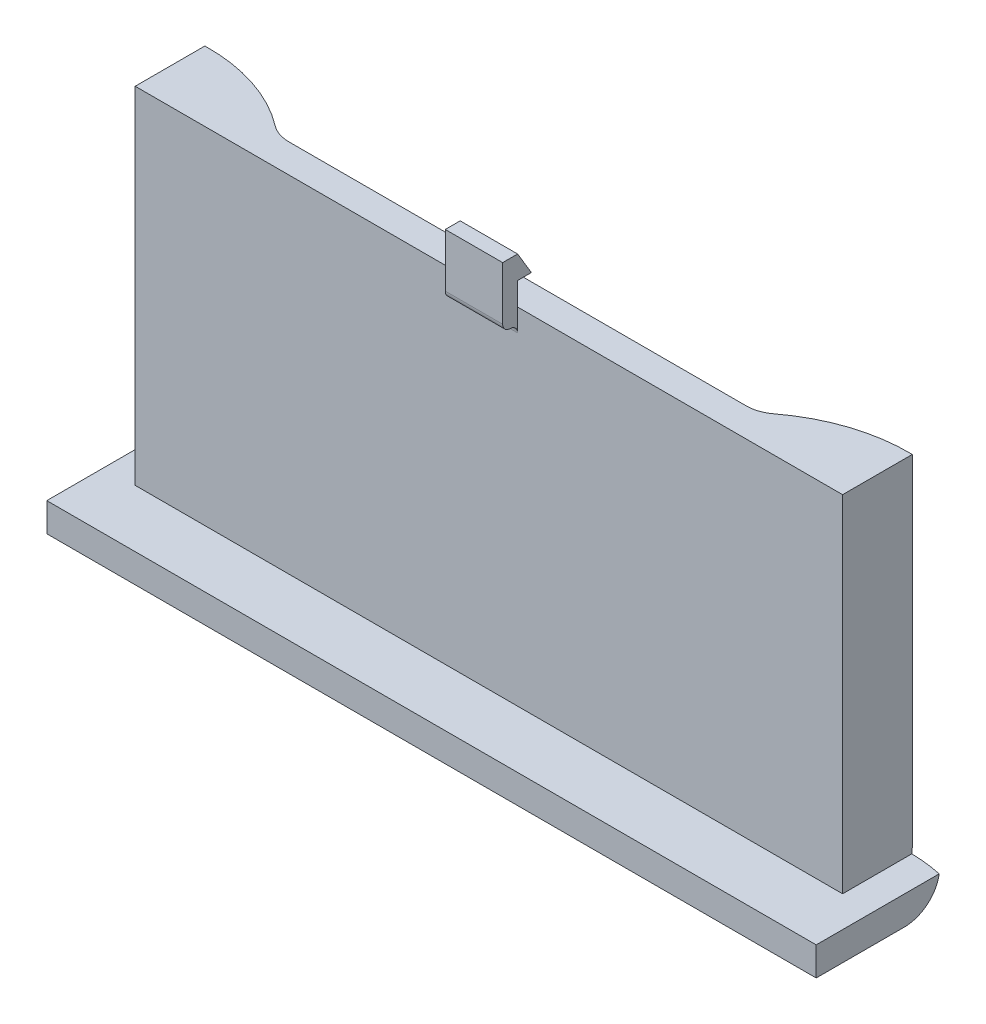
ISO-10303-21;
HEADER;
FILE_DESCRIPTION(('STEP AP214'),'2;1');
FILE_NAME('part.step','',(''),(''),'','','');
FILE_SCHEMA(('AUTOMOTIVE_DESIGN { 1 0 10303 214 1 1 1 1 }'));
ENDSEC;
DATA;
#1=APPLICATION_CONTEXT('core data for automotive mechanical design processes');
#2=APPLICATION_PROTOCOL_DEFINITION('international standard','automotive_design',2000,#1);
#3=PRODUCT_CONTEXT('',#1,'mechanical');
#4=PRODUCT('Part','Part','',(#3));
#5=PRODUCT_RELATED_PRODUCT_CATEGORY('part','',(#4));
#6=PRODUCT_DEFINITION_FORMATION('','',#4);
#7=PRODUCT_DEFINITION_CONTEXT('part definition',#1,'design');
#8=PRODUCT_DEFINITION('design','',#6,#7);
#9=PRODUCT_DEFINITION_SHAPE('','',#8);
#10=(LENGTH_UNIT() NAMED_UNIT(*) SI_UNIT(.MILLI.,.METRE.));
#11=(NAMED_UNIT(*) PLANE_ANGLE_UNIT() SI_UNIT($,.RADIAN.));
#12=(NAMED_UNIT(*) SI_UNIT($,.STERADIAN.) SOLID_ANGLE_UNIT());
#13=UNCERTAINTY_MEASURE_WITH_UNIT(LENGTH_MEASURE(1.E-05),#10,'distance_accuracy_value','');
#14=(GEOMETRIC_REPRESENTATION_CONTEXT(3) GLOBAL_UNCERTAINTY_ASSIGNED_CONTEXT((#13)) GLOBAL_UNIT_ASSIGNED_CONTEXT((#10,
#11,#12)) REPRESENTATION_CONTEXT('',''));
#15=CARTESIAN_POINT('',(0.,0.,0.));
#16=DIRECTION('',(0.,0.,1.));
#17=DIRECTION('',(1.,0.,0.));
#18=AXIS2_PLACEMENT_3D('',#15,#16,#17);
#19=CARTESIAN_POINT('',(31.7721686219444,-69.2765777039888,-8.42875272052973));
#20=DIRECTION('',(0.,0.,-1.));
#21=DIRECTION('',(-1.,0.,0.));
#22=AXIS2_PLACEMENT_3D('',#19,#20,#21);
#23=PLANE('',#22);
#24=DIRECTION('',(-1.,0.,0.));
#25=VECTOR('',#24,1.);
#26=CARTESIAN_POINT('',(-2.5,30.65,-8.42875272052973));
#27=LINE('',#26,#25);
#28=CARTESIAN_POINT('',(2.5,30.65,-8.42875272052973));
#29=VERTEX_POINT('',#28);
#30=CARTESIAN_POINT('',(-2.5,30.65,-8.42875272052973));
#31=VERTEX_POINT('',#30);
#32=EDGE_CURVE('E437',#29,#31,#27,.T.);
#33=ORIENTED_EDGE('',*,*,#32,.T.);
#34=DIRECTION('',(0.,1.,0.));
#35=VECTOR('',#34,1.);
#36=CARTESIAN_POINT('',(-2.5,34.6,-8.42875272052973));
#37=LINE('',#36,#35);
#38=CARTESIAN_POINT('',(-2.5,32.6,-8.42875272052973));
#39=VERTEX_POINT('',#38);
#40=EDGE_CURVE('E194',#31,#39,#37,.T.);
#41=ORIENTED_EDGE('',*,*,#40,.T.);
#42=DIRECTION('',(-1.,0.,0.));
#43=VECTOR('',#42,1.);
#44=CARTESIAN_POINT('',(31.7721686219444,32.6,-8.42875272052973));
#45=LINE('',#44,#43);
#46=CARTESIAN_POINT('',(-30.8,32.6,-8.42875272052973));
#47=VERTEX_POINT('',#46);
#48=EDGE_CURVE('E209',#39,#47,#45,.T.);
#49=ORIENTED_EDGE('',*,*,#48,.T.);
#50=DIRECTION('',(0.,-1.,0.));
#51=VECTOR('',#50,1.);
#52=CARTESIAN_POINT('',(-30.8,2.49999999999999,-8.42875272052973));
#53=LINE('',#52,#51);
#54=CARTESIAN_POINT('',(-30.8,2.49999999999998,-8.42875272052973));
#55=VERTEX_POINT('',#54);
#56=EDGE_CURVE('E223',#47,#55,#53,.T.);
#57=ORIENTED_EDGE('',*,*,#56,.T.);
#58=DIRECTION('',(1.,0.,0.));
#59=VECTOR('',#58,1.);
#60=CARTESIAN_POINT('',(31.7721686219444,2.50000000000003,-8.42875272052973));
#61=LINE('',#60,#59);
#62=CARTESIAN_POINT('',(30.8,2.50000000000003,-8.42875272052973));
#63=VERTEX_POINT('',#62);
#64=EDGE_CURVE('E219',#55,#63,#61,.T.);
#65=ORIENTED_EDGE('',*,*,#64,.T.);
#66=DIRECTION('',(0.,1.,0.));
#67=VECTOR('',#66,1.);
#68=CARTESIAN_POINT('',(30.8,2.5,-8.42875272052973));
#69=LINE('',#68,#67);
#70=CARTESIAN_POINT('',(30.8,32.6,-8.42875272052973));
#71=VERTEX_POINT('',#70);
#72=EDGE_CURVE('E221',#63,#71,#69,.T.);
#73=ORIENTED_EDGE('',*,*,#72,.T.);
#74=CARTESIAN_POINT('',(2.5,32.6,-8.42875272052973));
#75=VERTEX_POINT('',#74);
#76=EDGE_CURVE('E213',#71,#75,#45,.T.);
#77=ORIENTED_EDGE('',*,*,#76,.T.);
#78=DIRECTION('',(0.,1.,0.));
#79=VECTOR('',#78,1.);
#80=CARTESIAN_POINT('',(2.5,34.6,-8.42875272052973));
#81=LINE('',#80,#79);
#82=EDGE_CURVE('E462',#29,#75,#81,.T.);
#83=ORIENTED_EDGE('',*,*,#82,.F.);
#84=EDGE_LOOP('',(#33,#41,#49,#57,#65,#73,#77,#83));
#85=FACE_BOUND('',#84,.T.);
#86=ADVANCED_FACE('F28',(#85),#23,.F.);
#87=CARTESIAN_POINT('',(-30.5,79.,0.));
#88=DIRECTION('',(0.,-1.,0.));
#89=DIRECTION('',(0.,0.,-1.));
#90=AXIS2_PLACEMENT_3D('',#87,#88,#89);
#91=CYLINDRICAL_SURFACE('',#90,14.5);
#92=DIRECTION('',(0.,-1.,0.));
#93=VECTOR('',#92,1.);
#94=CARTESIAN_POINT('',(-30.8,79.,-14.4968962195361));
#95=LINE('',#94,#93);
#96=CARTESIAN_POINT('',(-30.8,32.6,-14.4968962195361));
#97=VERTEX_POINT('',#96);
#98=CARTESIAN_POINT('',(-30.8,2.99999999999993,-14.496896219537));
#99=VERTEX_POINT('',#98);
#100=EDGE_CURVE('E257',#97,#99,#95,.T.);
#101=ORIENTED_EDGE('',*,*,#100,.F.);
#102=CARTESIAN_POINT('',(-30.5,32.6,0.));
#103=DIRECTION('',(0.,1.,0.));
#104=DIRECTION('',(-1.,0.,0.));
#105=AXIS2_PLACEMENT_3D('',#102,#103,#104);
#106=CIRCLE('',#105,14.5);
#107=CARTESIAN_POINT('',(-21.7218400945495,32.6,-11.5409665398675));
#108=VERTEX_POINT('',#107);
#109=EDGE_CURVE('E265',#108,#97,#106,.T.);
#110=ORIENTED_EDGE('',*,*,#109,.F.);
#111=DIRECTION('',(0.,-1.,0.));
#112=VECTOR('',#111,1.);
#113=CARTESIAN_POINT('',(-21.7218400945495,79.,-11.5409665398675));
#114=LINE('',#113,#112);
#115=CARTESIAN_POINT('',(-21.7218400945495,3.,-11.5409665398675));
#116=VERTEX_POINT('',#115);
#117=EDGE_CURVE('E310',#108,#116,#114,.T.);
#118=ORIENTED_EDGE('',*,*,#117,.T.);
#119=CARTESIAN_POINT('',(-30.5,3.,0.));
#120=DIRECTION('',(0.,1.,0.));
#121=DIRECTION('',(0.,0.,1.));
#122=AXIS2_PLACEMENT_3D('',#119,#120,#121);
#123=CIRCLE('',#122,14.5);
#124=EDGE_CURVE('E312',#116,#99,#123,.T.);
#125=ORIENTED_EDGE('',*,*,#124,.T.);
#126=EDGE_LOOP('',(#101,#110,#118,#125));
#127=FACE_BOUND('',#126,.T.);
#128=ADVANCED_FACE('F30',(#127),#91,.T.);
#129=CARTESIAN_POINT('',(30.5,79.,0.));
#130=DIRECTION('',(0.,-1.,0.));
#131=DIRECTION('',(0.,0.,-1.));
#132=AXIS2_PLACEMENT_3D('',#129,#130,#131);
#133=CYLINDRICAL_SURFACE('',#132,14.5);
#134=CARTESIAN_POINT('',(30.5,32.6,0.));
#135=DIRECTION('',(0.,1.,0.));
#136=DIRECTION('',(-1.,0.,0.));
#137=AXIS2_PLACEMENT_3D('',#134,#135,#136);
#138=CIRCLE('',#137,14.5);
#139=CARTESIAN_POINT('',(30.8,32.6,-14.4968962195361));
#140=VERTEX_POINT('',#139);
#141=CARTESIAN_POINT('',(21.7218400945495,32.6,-11.5409665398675));
#142=VERTEX_POINT('',#141);
#143=EDGE_CURVE('E261',#140,#142,#138,.T.);
#144=ORIENTED_EDGE('',*,*,#143,.F.);
#145=DIRECTION('',(0.,-1.,0.));
#146=VECTOR('',#145,1.);
#147=CARTESIAN_POINT('',(30.8,79.,-14.4968962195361));
#148=LINE('',#147,#146);
#149=CARTESIAN_POINT('',(30.8,2.99999999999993,-14.496896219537));
#150=VERTEX_POINT('',#149);
#151=EDGE_CURVE('E236',#150,#140,#148,.F.);
#152=ORIENTED_EDGE('',*,*,#151,.F.);
#153=CARTESIAN_POINT('',(30.5,3.,0.));
#154=DIRECTION('',(0.,1.,0.));
#155=DIRECTION('',(0.,0.,1.));
#156=AXIS2_PLACEMENT_3D('',#153,#154,#155);
#157=CIRCLE('',#156,14.5);
#158=CARTESIAN_POINT('',(21.7218400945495,3.,-11.5409665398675));
#159=VERTEX_POINT('',#158);
#160=EDGE_CURVE('E301',#150,#159,#157,.T.);
#161=ORIENTED_EDGE('',*,*,#160,.T.);
#162=DIRECTION('',(0.,-1.,0.));
#163=VECTOR('',#162,1.);
#164=CARTESIAN_POINT('',(21.7218400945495,79.,-11.5409665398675));
#165=LINE('',#164,#163);
#166=EDGE_CURVE('E298',#159,#142,#165,.F.);
#167=ORIENTED_EDGE('',*,*,#166,.T.);
#168=EDGE_LOOP('',(#144,#152,#161,#167));
#169=FACE_BOUND('',#168,.T.);
#170=ADVANCED_FACE('F360',(#169),#133,.T.);
#171=CARTESIAN_POINT('',(-20.9704478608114,79.,-10.9287527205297));
#172=DIRECTION('',(0.,0.,1.));
#173=DIRECTION('',(1.,0.,0.));
#174=AXIS2_PLACEMENT_3D('',#171,#172,#173);
#175=PLANE('',#174);
#176=DIRECTION('',(-1.,0.,0.));
#177=VECTOR('',#176,1.);
#178=CARTESIAN_POINT('',(-20.9704478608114,32.6,-10.9287527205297));
#179=LINE('',#178,#177);
#180=CARTESIAN_POINT('',(19.9056690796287,32.6,-10.9287527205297));
#181=VERTEX_POINT('',#180);
#182=CARTESIAN_POINT('',(-19.9056690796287,32.6,-10.9287527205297));
#183=VERTEX_POINT('',#182);
#184=EDGE_CURVE('E259',#181,#183,#179,.T.);
#185=ORIENTED_EDGE('',*,*,#184,.F.);
#186=DIRECTION('',(0.,1.,0.));
#187=VECTOR('',#186,1.);
#188=CARTESIAN_POINT('',(19.9056690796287,0.,-10.9287527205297));
#189=LINE('',#188,#187);
#190=CARTESIAN_POINT('',(19.9056690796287,3.,-10.9287527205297));
#191=VERTEX_POINT('',#190);
#192=EDGE_CURVE('E308',#181,#191,#189,.F.);
#193=ORIENTED_EDGE('',*,*,#192,.T.);
#194=DIRECTION('',(-1.,0.,0.));
#195=VECTOR('',#194,1.);
#196=CARTESIAN_POINT('',(-20.9704478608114,3.,-10.9287527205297));
#197=LINE('',#196,#195);
#198=CARTESIAN_POINT('',(-19.9056690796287,3.,-10.9287527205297));
#199=VERTEX_POINT('',#198);
#200=EDGE_CURVE('E306',#191,#199,#197,.T.);
#201=ORIENTED_EDGE('',*,*,#200,.T.);
#202=DIRECTION('',(0.,1.,0.));
#203=VECTOR('',#202,1.);
#204=CARTESIAN_POINT('',(-19.9056690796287,79.,-10.9287527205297));
#205=LINE('',#204,#203);
#206=EDGE_CURVE('E303',#199,#183,#205,.T.);
#207=ORIENTED_EDGE('',*,*,#206,.T.);
#208=EDGE_LOOP('',(#185,#193,#201,#207));
#209=FACE_BOUND('',#208,.T.);
#210=ADVANCED_FACE('F416',(#209),#175,.F.);
#211=CARTESIAN_POINT('',(-30.5,0.,0.));
#212=DIRECTION('',(0.,1.,0.));
#213=DIRECTION('',(0.,0.,1.));
#214=AXIS2_PLACEMENT_3D('',#211,#212,#213);
#215=PLANE('',#214);
#216=DIRECTION('',(0.,0.,1.));
#217=VECTOR('',#216,1.);
#218=CARTESIAN_POINT('',(33.5,0.,-15.));
#219=LINE('',#218,#217);
#220=CARTESIAN_POINT('',(33.5,0.,-11.1018016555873));
#221=VERTEX_POINT('',#220);
#222=CARTESIAN_POINT('',(33.5,0.,-3.43));
#223=VERTEX_POINT('',#222);
#224=EDGE_CURVE('E237',#221,#223,#219,.T.);
#225=ORIENTED_EDGE('',*,*,#224,.T.);
#226=DIRECTION('',(1.,0.,0.));
#227=VECTOR('',#226,1.);
#228=CARTESIAN_POINT('',(35.6643414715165,0.,-3.43));
#229=LINE('',#228,#227);
#230=CARTESIAN_POINT('',(-33.5,0.,-3.43));
#231=VERTEX_POINT('',#230);
#232=EDGE_CURVE('E225',#231,#223,#229,.T.);
#233=ORIENTED_EDGE('',*,*,#232,.F.);
#234=DIRECTION('',(0.,0.,1.));
#235=VECTOR('',#234,1.);
#236=CARTESIAN_POINT('',(-33.5,0.,-15.));
#237=LINE('',#236,#235);
#238=CARTESIAN_POINT('',(-33.5,0.,-11.1018016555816));
#239=VERTEX_POINT('',#238);
#240=EDGE_CURVE('E240',#239,#231,#237,.T.);
#241=ORIENTED_EDGE('',*,*,#240,.F.);
#242=CARTESIAN_POINT('',(-30.5,0.,0.));
#243=DIRECTION('',(0.,1.,0.));
#244=DIRECTION('',(0.,0.,1.));
#245=AXIS2_PLACEMENT_3D('',#242,#243,#244);
#246=CIRCLE('',#245,11.5);
#247=CARTESIAN_POINT('',(-23.5380111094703,0.,-9.15318035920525));
#248=VERTEX_POINT('',#247);
#249=EDGE_CURVE('E288',#239,#248,#246,.F.);
#250=ORIENTED_EDGE('',*,*,#249,.T.);
#251=CARTESIAN_POINT('',(-19.9056690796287,0.,-13.9287527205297));
#252=DIRECTION('',(0.,1.,0.));
#253=DIRECTION('',(0.,0.,1.));
#254=AXIS2_PLACEMENT_3D('',#251,#252,#253);
#255=CIRCLE('',#254,6.);
#256=CARTESIAN_POINT('',(-19.9056690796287,0.,-7.92875272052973));
#257=VERTEX_POINT('',#256);
#258=EDGE_CURVE('E285',#257,#248,#255,.F.);
#259=ORIENTED_EDGE('',*,*,#258,.F.);
#260=DIRECTION('',(-1.,0.,0.));
#261=VECTOR('',#260,1.);
#262=CARTESIAN_POINT('',(-30.5,0.,-7.92875272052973));
#263=LINE('',#262,#261);
#264=CARTESIAN_POINT('',(19.9056690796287,0.,-7.92875272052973));
#265=VERTEX_POINT('',#264);
#266=EDGE_CURVE('E290',#257,#265,#263,.F.);
#267=ORIENTED_EDGE('',*,*,#266,.T.);
#268=CARTESIAN_POINT('',(19.9056690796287,0.,-13.9287527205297));
#269=DIRECTION('',(0.,1.,0.));
#270=DIRECTION('',(0.,0.,1.));
#271=AXIS2_PLACEMENT_3D('',#268,#269,#270);
#272=CIRCLE('',#271,6.);
#273=CARTESIAN_POINT('',(23.5380111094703,0.,-9.15318035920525));
#274=VERTEX_POINT('',#273);
#275=EDGE_CURVE('E292',#274,#265,#272,.F.);
#276=ORIENTED_EDGE('',*,*,#275,.F.);
#277=CARTESIAN_POINT('',(30.5,0.,0.));
#278=DIRECTION('',(0.,1.,0.));
#279=DIRECTION('',(0.,0.,1.));
#280=AXIS2_PLACEMENT_3D('',#277,#278,#279);
#281=CIRCLE('',#280,11.5);
#282=EDGE_CURVE('E295',#274,#221,#281,.F.);
#283=ORIENTED_EDGE('',*,*,#282,.T.);
#284=EDGE_LOOP('',(#225,#233,#241,#250,#259,#267,#276,#283));
#285=FACE_BOUND('',#284,.T.);
#286=ADVANCED_FACE('F412',(#285),#215,.F.);
#287=CARTESIAN_POINT('',(-19.9056690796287,79.,-13.9287527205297));
#288=DIRECTION('',(0.,-1.,0.));
#289=DIRECTION('',(0.,0.,-1.));
#290=AXIS2_PLACEMENT_3D('',#287,#288,#289);
#291=CYLINDRICAL_SURFACE('',#290,3.);
#292=CARTESIAN_POINT('',(-19.9056690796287,32.6,-13.9287527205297));
#293=DIRECTION('',(0.,1.,0.));
#294=DIRECTION('',(-1.,0.,0.));
#295=AXIS2_PLACEMENT_3D('',#292,#293,#294);
#296=CIRCLE('',#295,3.);
#297=EDGE_CURVE('E263',#183,#108,#296,.F.);
#298=ORIENTED_EDGE('',*,*,#297,.F.);
#299=ORIENTED_EDGE('',*,*,#206,.F.);
#300=CARTESIAN_POINT('',(-19.9056690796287,3.,-13.9287527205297));
#301=DIRECTION('',(0.,1.,0.));
#302=DIRECTION('',(0.,0.,1.));
#303=AXIS2_PLACEMENT_3D('',#300,#301,#302);
#304=CIRCLE('',#303,3.);
#305=EDGE_CURVE('E279',#116,#199,#304,.T.);
#306=ORIENTED_EDGE('',*,*,#305,.F.);
#307=ORIENTED_EDGE('',*,*,#117,.F.);
#308=EDGE_LOOP('',(#298,#299,#306,#307));
#309=FACE_BOUND('',#308,.T.);
#310=ADVANCED_FACE('F408',(#309),#291,.F.);
#311=CARTESIAN_POINT('',(19.9056690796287,79.,-13.9287527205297));
#312=DIRECTION('',(0.,-1.,0.));
#313=DIRECTION('',(0.,0.,-1.));
#314=AXIS2_PLACEMENT_3D('',#311,#312,#313);
#315=CYLINDRICAL_SURFACE('',#314,3.);
#316=CARTESIAN_POINT('',(19.9056690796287,32.6,-13.9287527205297));
#317=DIRECTION('',(0.,1.,0.));
#318=DIRECTION('',(-1.,0.,0.));
#319=AXIS2_PLACEMENT_3D('',#316,#317,#318);
#320=CIRCLE('',#319,3.);
#321=EDGE_CURVE('E381',#142,#181,#320,.F.);
#322=ORIENTED_EDGE('',*,*,#321,.F.);
#323=ORIENTED_EDGE('',*,*,#166,.F.);
#324=CARTESIAN_POINT('',(19.9056690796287,3.,-13.9287527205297));
#325=DIRECTION('',(0.,1.,0.));
#326=DIRECTION('',(0.,0.,1.));
#327=AXIS2_PLACEMENT_3D('',#324,#325,#326);
#328=CIRCLE('',#327,3.);
#329=EDGE_CURVE('E276',#191,#159,#328,.T.);
#330=ORIENTED_EDGE('',*,*,#329,.F.);
#331=ORIENTED_EDGE('',*,*,#192,.F.);
#332=EDGE_LOOP('',(#322,#323,#330,#331));
#333=FACE_BOUND('',#332,.T.);
#334=ADVANCED_FACE('F391',(#333),#315,.F.);
#335=CARTESIAN_POINT('',(-30.5,3.,0.));
#336=DIRECTION('',(0.,1.,0.));
#337=DIRECTION('',(0.,0.,1.));
#338=AXIS2_PLACEMENT_3D('',#335,#336,#337);
#339=TOROIDAL_SURFACE('',#338,11.5,3.);
#340=ORIENTED_EDGE('',*,*,#249,.F.);
#341=CARTESIAN_POINT('',(-33.5,1.24222959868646,-13.6042465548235));
#342=CARTESIAN_POINT('',(-33.5,1.37583643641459,-13.7031614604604));
#343=CARTESIAN_POINT('',(-33.5,1.51778579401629,-13.7909884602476));
#344=CARTESIAN_POINT('',(-33.5,1.81449546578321,-13.9416967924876));
#345=CARTESIAN_POINT('',(-33.5,1.96926827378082,-14.0045534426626));
#346=CARTESIAN_POINT('',(-33.5,2.28722320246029,-14.1032848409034));
#347=CARTESIAN_POINT('',(-33.5,2.45040574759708,-14.1391582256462));
#348=CARTESIAN_POINT('',(-33.5,2.78045325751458,-14.1827646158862));
#349=CARTESIAN_POINT('',(-33.5,2.94731740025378,-14.1905038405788));
#350=CARTESIAN_POINT('',(-33.5,3.27876635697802,-14.177662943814));
#351=CARTESIAN_POINT('',(-33.5,3.44335894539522,-14.157282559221));
#352=CARTESIAN_POINT('',(-33.5,3.76678881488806,-14.0891951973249));
#353=CARTESIAN_POINT('',(-33.5,3.92562601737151,-14.0414878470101));
#354=CARTESIAN_POINT('',(-33.5,4.23322732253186,-13.9201740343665));
#355=CARTESIAN_POINT('',(-33.5,4.38198275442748,-13.8465456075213));
#356=CARTESIAN_POINT('',(-33.5,4.66521509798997,-13.675643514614));
#357=CARTESIAN_POINT('',(-33.5,4.79969145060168,-13.5783689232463));
#358=CARTESIAN_POINT('',(-33.5,5.05235207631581,-13.3617607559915));
#359=CARTESIAN_POINT('',(-33.5,5.17032008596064,-13.2421750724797));
#360=CARTESIAN_POINT('',(-33.5,5.38501122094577,-12.9852638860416));
#361=CARTESIAN_POINT('',(-33.5,5.4817324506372,-12.8479368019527));
#362=CARTESIAN_POINT('',(-33.5,5.65347190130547,-12.5563087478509));
#363=CARTESIAN_POINT('',(-33.5,5.7279758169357,-12.4017050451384));
#364=CARTESIAN_POINT('',(-33.5,5.85075070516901,-12.0824190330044));
#365=CARTESIAN_POINT('',(-33.5,5.89901822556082,-11.9177354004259));
#366=CARTESIAN_POINT('',(-33.5,5.96935721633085,-11.5781470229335));
#367=CARTESIAN_POINT('',(-33.5,5.99067314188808,-11.4030857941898));
#368=CARTESIAN_POINT('',(-33.5,6.00441597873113,-11.0518335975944));
#369=CARTESIAN_POINT('',(-33.5,5.99683855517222,-10.875642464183));
#370=CARTESIAN_POINT('',(-33.5,5.95266694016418,-10.5222789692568));
#371=CARTESIAN_POINT('',(-33.5,5.91532453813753,-10.3451998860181));
#372=CARTESIAN_POINT('',(-33.5,5.81180870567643,-9.99966071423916));
#373=CARTESIAN_POINT('',(-33.5,5.74563152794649,-9.83120174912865));
#374=CARTESIAN_POINT('',(-33.5,5.58519963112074,-9.50573766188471));
#375=CARTESIAN_POINT('',(-33.5,5.49062471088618,-9.34889004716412));
#376=CARTESIAN_POINT('',(-33.5,5.27602969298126,-9.05364518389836));
#377=CARTESIAN_POINT('',(-33.5,5.15600994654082,-8.91524768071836));
#378=CARTESIAN_POINT('',(-33.5,4.89597133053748,-8.66391973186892));
#379=CARTESIAN_POINT('',(-33.5,4.7563606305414,-8.55056792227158));
#380=CARTESIAN_POINT('',(-33.5,4.45922620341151,-8.35043123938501));
#381=CARTESIAN_POINT('',(-33.5,4.30170897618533,-8.26363676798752));
#382=CARTESIAN_POINT('',(-33.5,3.98195493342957,-8.12409184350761));
#383=CARTESIAN_POINT('',(-33.5,3.82038832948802,-8.06980713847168));
#384=CARTESIAN_POINT('',(-33.5,3.49017727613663,-7.99091969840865));
#385=CARTESIAN_POINT('',(-33.5,3.32153581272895,-7.96630456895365));
#386=CARTESIAN_POINT('',(-33.5,2.99189868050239,-7.94841716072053));
#387=CARTESIAN_POINT('',(-33.5,2.83099016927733,-7.95350198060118));
#388=CARTESIAN_POINT('',(-33.5,2.51240306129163,-7.99098044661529));
#389=CARTESIAN_POINT('',(-33.5,2.35472420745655,-8.02337191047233));
#390=CARTESIAN_POINT('',(-33.5,2.04884671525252,-8.11355146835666));
#391=CARTESIAN_POINT('',(-33.5,1.90055901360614,-8.17103920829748));
#392=CARTESIAN_POINT('',(-33.5,1.61520792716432,-8.30916234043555));
#393=CARTESIAN_POINT('',(-33.5,1.47814635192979,-8.38980145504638));
#394=CARTESIAN_POINT('',(-33.5,1.21320569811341,-8.5751546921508));
#395=CARTESIAN_POINT('',(-33.5,1.08590713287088,-8.6806974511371));
#396=CARTESIAN_POINT('',(-33.5,0.849620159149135,-8.91059121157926));
#397=CARTESIAN_POINT('',(-33.5,0.740636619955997,-9.03494719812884));
#398=CARTESIAN_POINT('',(-33.5,0.537560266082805,-9.3066330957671));
#399=CARTESIAN_POINT('',(-33.5,0.444683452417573,-9.45487268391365));
#400=CARTESIAN_POINT('',(-33.5,0.284040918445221,-9.76439064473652));
#401=CARTESIAN_POINT('',(-33.5,0.216280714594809,-9.92567187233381));
#402=CARTESIAN_POINT('',(-33.5,0.105383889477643,-10.2634388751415));
#403=CARTESIAN_POINT('',(-33.5,0.0633001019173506,-10.4402713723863));
#404=CARTESIAN_POINT('',(-33.5,0.00921358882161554,-10.7984846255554));
#405=CARTESIAN_POINT('',(-33.5,-0.00278823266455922,-10.9798655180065));
#406=CARTESIAN_POINT('',(-33.5,0.00389549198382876,-11.3431190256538));
#407=CARTESIAN_POINT('',(-33.5,0.0227565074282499,-11.5249885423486));
#408=CARTESIAN_POINT('',(-33.5,0.0913536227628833,-11.8828743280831));
#409=CARTESIAN_POINT('',(-33.5,0.141095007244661,-12.0588895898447));
#410=CARTESIAN_POINT('',(-33.5,0.269194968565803,-12.3964612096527));
#411=CARTESIAN_POINT('',(-33.5,0.347009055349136,-12.5582243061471));
#412=CARTESIAN_POINT('',(-33.5,0.529410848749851,-12.8657010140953));
#413=CARTESIAN_POINT('',(-33.5,0.63396121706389,-13.0114366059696));
#414=CARTESIAN_POINT('',(-33.5,0.823548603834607,-13.2318738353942));
#415=CARTESIAN_POINT('',(-33.5,0.901409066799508,-13.3128535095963));
#416=CARTESIAN_POINT('',(-33.5,1.06565591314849,-13.4656549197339));
#417=CARTESIAN_POINT('',(-33.5,1.15204210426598,-13.5374768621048));
#418=CARTESIAN_POINT('',(-33.5,1.24222959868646,-13.6042465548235));
#419=B_SPLINE_CURVE_WITH_KNOTS('',3,(#341,#342,#343,#344,#345,#346,#347,#348,#349,#350,#351,
#352,#353,#354,#355,#356,#357,#358,#359,#360,#361,#362,#363,#364,#365,#366,#367,#368,#369,#370,
#371,#372,#373,#374,#375,#376,#377,#378,#379,#380,#381,#382,#383,#384,#385,#386,#387,#388,#389,
#390,#391,#392,#393,#394,#395,#396,#397,#398,#399,#400,#401,#402,#403,#404,#405,#406,#407,#408,
#409,#410,#411,#412,#413,#414,#415,#416,#417,#418),.UNSPECIFIED.,.T.,.F.,(4,2,2,2,2,2,2,2,2,2,2,
2,2,2,2,2,2,2,2,2,2,2,2,2,2,2,2,2,2,2,2,2,2,2,2,2,2,2,4),(0.,0.498310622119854,
0.997112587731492,1.49593975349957,1.99465664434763,2.48984926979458,2.98504865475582,
3.48066866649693,3.97630807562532,4.47793053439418,4.97959773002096,5.49210857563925,
6.0046868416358,6.53133704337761,7.05806626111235,7.59847013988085,8.13894426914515,
8.6857572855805,9.23256275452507,9.76931704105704,10.3058771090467,10.8145648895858,
11.3230400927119,11.8036644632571,12.2842504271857,12.7592359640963,13.2342979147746,
13.7282185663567,14.2222703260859,14.7447202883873,15.2672849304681,15.8100451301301,
16.3528216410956,16.8986948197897,17.4446614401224,17.9805626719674,18.5157195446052,
18.8520975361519,19.1884679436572),.UNSPECIFIED.);
#420=CARTESIAN_POINT('',(-33.5,2.49999999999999,-14.1433700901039));
#421=VERTEX_POINT('',#420);
#422=EDGE_CURVE('E375',#239,#421,#419,.T.);
#423=ORIENTED_EDGE('',*,*,#422,.T.);
#424=CARTESIAN_POINT('',(-30.5,2.49999999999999,0.));
#425=DIRECTION('',(0.,1.,0.));
#426=DIRECTION('',(-1.,0.,0.));
#427=AXIS2_PLACEMENT_3D('',#424,#425,#426);
#428=CIRCLE('',#427,14.4580398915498);
#429=CARTESIAN_POINT('',(-30.8,2.49999999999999,-14.4549271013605));
#430=VERTEX_POINT('',#429);
#431=EDGE_CURVE('E382',#421,#430,#428,.F.);
#432=ORIENTED_EDGE('',*,*,#431,.T.);
#433=CARTESIAN_POINT('',(-30.8,2.76373310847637,-14.4875760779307));
#434=CARTESIAN_POINT('',(-30.8,2.93169018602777,-14.500840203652));
#435=CARTESIAN_POINT('',(-30.8,3.10088984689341,-14.4999296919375));
#436=CARTESIAN_POINT('',(-30.8,3.4368750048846,-14.4697097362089));
#437=CARTESIAN_POINT('',(-30.8,3.60365734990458,-14.4403660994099));
#438=CARTESIAN_POINT('',(-30.8,3.92986145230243,-14.3541005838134));
#439=CARTESIAN_POINT('',(-30.8,4.08928670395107,-14.297191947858));
#440=CARTESIAN_POINT('',(-30.8,4.39627647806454,-14.1574329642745));
#441=CARTESIAN_POINT('',(-30.8,4.54384393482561,-14.0745890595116));
#442=CARTESIAN_POINT('',(-30.8,4.82300564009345,-13.8852928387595));
#443=CARTESIAN_POINT('',(-30.8,4.95459719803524,-13.7788365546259));
#444=CARTESIAN_POINT('',(-30.8,5.198049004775,-13.5453421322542));
#445=CARTESIAN_POINT('',(-30.8,5.30990846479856,-13.4183031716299));
#446=CARTESIAN_POINT('',(-30.8,5.51073578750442,-13.1472306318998));
#447=CARTESIAN_POINT('',(-30.8,5.59969981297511,-13.0031942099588));
#448=CARTESIAN_POINT('',(-30.8,5.75219044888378,-12.7022332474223));
#449=CARTESIAN_POINT('',(-30.8,5.81571707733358,-12.5453087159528));
#450=CARTESIAN_POINT('',(-30.8,5.9155477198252,-12.222982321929));
#451=CARTESIAN_POINT('',(-30.8,5.95184464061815,-12.0575782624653));
#452=CARTESIAN_POINT('',(-30.8,5.99616228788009,-11.7230247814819));
#453=CARTESIAN_POINT('',(-30.8,6.00418302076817,-11.5538753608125));
#454=CARTESIAN_POINT('',(-30.8,5.9917220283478,-11.2165847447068));
#455=CARTESIAN_POINT('',(-30.8,5.97123275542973,-11.0484438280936));
#456=CARTESIAN_POINT('',(-30.8,5.90232122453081,-10.7179866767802));
#457=CARTESIAN_POINT('',(-30.8,5.85389889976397,-10.5556704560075));
#458=CARTESIAN_POINT('',(-30.8,5.73048536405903,-10.2414446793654));
#459=CARTESIAN_POINT('',(-30.8,5.65549002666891,-10.0895367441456));
#460=CARTESIAN_POINT('',(-30.8,5.48105847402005,-9.80046899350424));
#461=CARTESIAN_POINT('',(-30.8,5.3816222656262,-9.66330917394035));
#462=CARTESIAN_POINT('',(-30.8,5.16113891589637,-9.40764749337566));
#463=CARTESIAN_POINT('',(-30.8,5.04009381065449,-9.28914387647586));
#464=CARTESIAN_POINT('',(-30.8,4.77981949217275,-9.07415022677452));
#465=CARTESIAN_POINT('',(-30.8,4.64059031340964,-8.97766015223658));
#466=CARTESIAN_POINT('',(-30.8,4.34795975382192,-8.80947680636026));
#467=CARTESIAN_POINT('',(-30.8,4.19456417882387,-8.73777343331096));
#468=CARTESIAN_POINT('',(-30.8,3.87790784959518,-8.62115350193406));
#469=CARTESIAN_POINT('',(-30.8,3.71464713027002,-8.57623684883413));
#470=CARTESIAN_POINT('',(-30.8,3.38299088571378,-8.51448951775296));
#471=CARTESIAN_POINT('',(-30.8,3.21459822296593,-8.49764346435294));
#472=CARTESIAN_POINT('',(-30.8,2.87737560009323,-8.49247041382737));
#473=CARTESIAN_POINT('',(-30.8,2.70854564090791,-8.50414335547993));
#474=CARTESIAN_POINT('',(-30.8,2.37529258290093,-8.55566735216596));
#475=CARTESIAN_POINT('',(-30.8,2.21086821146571,-8.59551017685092));
#476=CARTESIAN_POINT('',(-30.8,1.89104000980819,-8.70222895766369));
#477=CARTESIAN_POINT('',(-30.8,1.73563618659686,-8.76910493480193));
#478=CARTESIAN_POINT('',(-30.8,1.4382223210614,-8.92800312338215));
#479=CARTESIAN_POINT('',(-30.8,1.29621518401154,-9.02003077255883));
#480=CARTESIAN_POINT('',(-30.8,1.02965567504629,-9.22660887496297));
#481=CARTESIAN_POINT('',(-30.8,0.90510335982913,-9.34115940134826));
#482=CARTESIAN_POINT('',(-30.8,0.676918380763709,-9.5895972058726));
#483=CARTESIAN_POINT('',(-30.8,0.573296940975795,-9.72349479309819));
#484=CARTESIAN_POINT('',(-30.8,0.389992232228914,-10.0067794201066));
#485=CARTESIAN_POINT('',(-30.8,0.310308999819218,-10.1561664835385));
#486=CARTESIAN_POINT('',(-30.8,0.177107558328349,-10.4662625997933));
#487=CARTESIAN_POINT('',(-30.8,0.123601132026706,-10.6269767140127));
#488=CARTESIAN_POINT('',(-30.8,0.0443246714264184,-10.9551064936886));
#489=CARTESIAN_POINT('',(-30.8,0.0185547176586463,-11.1225221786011));
#490=CARTESIAN_POINT('',(-30.8,-0.00451766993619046,-11.4593283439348));
#491=CARTESIAN_POINT('',(-30.8,-0.00181599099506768,-11.6287191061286));
#492=CARTESIAN_POINT('',(-30.8,0.0319909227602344,-11.9646425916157));
#493=CARTESIAN_POINT('',(-30.8,0.0630962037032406,-12.1311753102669));
#494=CARTESIAN_POINT('',(-30.8,0.152825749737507,-12.4566355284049));
#495=CARTESIAN_POINT('',(-30.8,0.211447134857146,-12.6155638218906));
#496=CARTESIAN_POINT('',(-30.8,0.354544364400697,-12.9213129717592));
#497=CARTESIAN_POINT('',(-30.8,0.439019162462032,-13.06813431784));
#498=CARTESIAN_POINT('',(-30.8,0.63139154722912,-13.3454538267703));
#499=CARTESIAN_POINT('',(-30.8,0.739280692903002,-13.4759578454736));
#500=CARTESIAN_POINT('',(-30.8,0.975474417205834,-13.7170279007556));
#501=CARTESIAN_POINT('',(-30.8,1.10378403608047,-13.8275890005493));
#502=CARTESIAN_POINT('',(-30.8,1.37716334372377,-14.025606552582));
#503=CARTESIAN_POINT('',(-30.8,1.52223658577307,-14.1130580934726));
#504=CARTESIAN_POINT('',(-30.8,1.82489646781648,-14.2622621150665));
#505=CARTESIAN_POINT('',(-30.8,1.98246782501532,-14.3240454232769));
#506=CARTESIAN_POINT('',(-30.8,2.24489780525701,-14.4022045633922));
#507=CARTESIAN_POINT('',(-30.8,2.34735092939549,-14.4269197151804));
#508=CARTESIAN_POINT('',(-30.8,2.55428529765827,-14.465460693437));
#509=CARTESIAN_POINT('',(-30.8,2.65876654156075,-14.4792865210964));
#510=CARTESIAN_POINT('',(-30.8,2.76373310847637,-14.4875760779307));
#511=B_SPLINE_CURVE_WITH_KNOTS('',3,(#433,#434,#435,#436,#437,#438,#439,#440,#441,#442,#443,
#444,#445,#446,#447,#448,#449,#450,#451,#452,#453,#454,#455,#456,#457,#458,#459,#460,#461,#462,
#463,#464,#465,#466,#467,#468,#469,#470,#471,#472,#473,#474,#475,#476,#477,#478,#479,#480,#481,
#482,#483,#484,#485,#486,#487,#488,#489,#490,#491,#492,#493,#494,#495,#496,#497,#498,#499,#500,
#501,#502,#503,#504,#505,#506,#507,#508,#509,#510),.UNSPECIFIED.,.T.,.F.,(4,2,2,2,2,2,2,2,2,2,2,
2,2,2,2,2,2,2,2,2,2,2,2,2,2,2,2,2,2,2,2,2,2,2,2,2,2,2,4),(0.,0.505055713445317,1.01071954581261,
1.51614068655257,2.02143636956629,2.52681703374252,3.03221789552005,3.53770340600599,
4.04318855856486,4.54880534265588,5.05442201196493,5.56017256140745,6.06592432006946,
6.5717546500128,7.07758483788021,7.58336738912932,8.08914898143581,8.5947242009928,
9.10029763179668,9.60559404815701,10.1108893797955,10.6160371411,11.1211852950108,
11.6264427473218,12.1317018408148,12.6372311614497,13.1427612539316,13.6485186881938,
14.1542775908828,14.6601095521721,15.1659423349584,15.671722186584,16.1774815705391,
16.6830589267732,17.1887612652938,17.6945709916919,18.1997714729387,18.5154114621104,
18.8310514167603),.UNSPECIFIED.);
#512=EDGE_CURVE('E383',#430,#99,#511,.T.);
#513=ORIENTED_EDGE('',*,*,#512,.T.);
#514=ORIENTED_EDGE('',*,*,#124,.F.);
#515=CARTESIAN_POINT('',(-23.5380111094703,3.,-9.15318035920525));
#516=DIRECTION('',(0.795928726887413,0.,0.605390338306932));
#517=DIRECTION('',(0.605390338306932,0.,-0.795928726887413));
#518=AXIS2_PLACEMENT_3D('',#515,#516,#517);
#519=CIRCLE('',#518,3.);
#520=EDGE_CURVE('E270',#116,#248,#519,.F.);
#521=ORIENTED_EDGE('',*,*,#520,.T.);
#522=EDGE_LOOP('',(#340,#423,#432,#513,#514,#521));
#523=FACE_BOUND('',#522,.T.);
#524=ADVANCED_FACE('F387',(#523),#339,.T.);
#525=CARTESIAN_POINT('',(30.5,3.,0.));
#526=DIRECTION('',(0.,1.,0.));
#527=DIRECTION('',(0.,0.,1.));
#528=AXIS2_PLACEMENT_3D('',#525,#526,#527);
#529=TOROIDAL_SURFACE('',#528,11.5,3.);
#530=CARTESIAN_POINT('',(30.5,2.5,0.));
#531=DIRECTION('',(0.,1.,0.));
#532=DIRECTION('',(-1.,0.,0.));
#533=AXIS2_PLACEMENT_3D('',#530,#531,#532);
#534=CIRCLE('',#533,14.4580398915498);
#535=CARTESIAN_POINT('',(30.8,2.5,-14.4549271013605));
#536=VERTEX_POINT('',#535);
#537=CARTESIAN_POINT('',(33.5,2.5,-14.1433700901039));
#538=VERTEX_POINT('',#537);
#539=EDGE_CURVE('E316',#536,#538,#534,.F.);
#540=ORIENTED_EDGE('',*,*,#539,.T.);
#541=CARTESIAN_POINT('',(33.5,1.24222959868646,-13.6042465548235));
#542=CARTESIAN_POINT('',(33.5,1.10453755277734,-13.5022875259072));
#543=CARTESIAN_POINT('',(33.5,0.97550133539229,-13.388393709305));
#544=CARTESIAN_POINT('',(33.5,0.73843067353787,-13.140322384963));
#545=CARTESIAN_POINT('',(33.5,0.630427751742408,-13.0061149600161));
#546=CARTESIAN_POINT('',(33.5,0.438499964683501,-12.7217814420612));
#547=CARTESIAN_POINT('',(33.5,0.35453684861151,-12.5716811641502));
#548=CARTESIAN_POINT('',(33.5,0.212460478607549,-12.2597865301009));
#549=CARTESIAN_POINT('',(33.5,0.154340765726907,-12.0979951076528));
#550=CARTESIAN_POINT('',(33.5,0.064184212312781,-11.7637636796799));
#551=CARTESIAN_POINT('',(33.5,0.0327034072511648,-11.5911738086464));
#552=CARTESIAN_POINT('',(33.5,-0.00166887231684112,-11.2431639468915));
#553=CARTESIAN_POINT('',(33.5,-0.00455481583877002,-11.0677434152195));
#554=CARTESIAN_POINT('',(33.5,0.0183713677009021,-10.7140103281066));
#555=CARTESIAN_POINT('',(33.5,0.0449626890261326,-10.5357480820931));
#556=CARTESIAN_POINT('',(33.5,0.127210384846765,-10.1860460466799));
#557=CARTESIAN_POINT('',(33.5,0.182870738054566,-10.014607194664));
#558=CARTESIAN_POINT('',(33.5,0.322866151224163,-9.68071113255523));
#559=CARTESIAN_POINT('',(33.5,0.40763201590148,-9.51843417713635));
#560=CARTESIAN_POINT('',(33.5,0.603507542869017,-9.21060294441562));
#561=CARTESIAN_POINT('',(33.5,0.714617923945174,-9.06504912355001));
#562=CARTESIAN_POINT('',(33.5,0.958944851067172,-8.7969992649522));
#563=CARTESIAN_POINT('',(33.5,1.09188068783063,-8.67424793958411));
#564=CARTESIAN_POINT('',(33.5,1.37734473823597,-8.45411600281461));
#565=CARTESIAN_POINT('',(33.5,1.52986710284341,-8.35672784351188));
#566=CARTESIAN_POINT('',(33.5,1.84259479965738,-8.19526218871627));
#567=CARTESIAN_POINT('',(33.5,2.0021014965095,-8.12983354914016));
#568=CARTESIAN_POINT('',(33.5,2.33023721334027,-8.02857047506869));
#569=CARTESIAN_POINT('',(33.5,2.49886207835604,-7.99272268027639));
#570=CARTESIAN_POINT('',(33.5,2.82991080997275,-7.95349027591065));
#571=CARTESIAN_POINT('',(33.5,2.99212771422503,-7.94834473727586));
#572=CARTESIAN_POINT('',(33.5,3.31501138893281,-7.96603612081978));
#573=CARTESIAN_POINT('',(33.5,3.47567837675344,-7.98886905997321));
#574=CARTESIAN_POINT('',(33.5,3.78733864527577,-8.06071094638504));
#575=CARTESIAN_POINT('',(33.5,3.93846607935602,-8.10914222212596));
#576=CARTESIAN_POINT('',(33.5,4.23082579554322,-8.22991150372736));
#577=CARTESIAN_POINT('',(33.5,4.37205679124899,-8.30225261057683));
#578=CARTESIAN_POINT('',(33.5,4.6456243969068,-8.47099784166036));
#579=CARTESIAN_POINT('',(33.5,4.77752918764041,-8.56810069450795));
#580=CARTESIAN_POINT('',(33.5,5.02429979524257,-8.78195236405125));
#581=CARTESIAN_POINT('',(33.5,5.13916124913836,-8.8987061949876));
#582=CARTESIAN_POINT('',(33.5,5.35550244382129,-9.15573400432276));
#583=CARTESIAN_POINT('',(33.5,5.45583594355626,-9.29697324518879));
#584=CARTESIAN_POINT('',(33.5,5.63255585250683,-9.59371628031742));
#585=CARTESIAN_POINT('',(33.5,5.70893658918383,-9.74922344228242));
#586=CARTESIAN_POINT('',(33.5,5.838796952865,-10.0774710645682));
#587=CARTESIAN_POINT('',(33.5,5.89112502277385,-10.2506682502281));
#588=CARTESIAN_POINT('',(33.5,5.96634975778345,-10.6033524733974));
#589=CARTESIAN_POINT('',(33.5,5.98924352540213,-10.7828401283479));
#590=CARTESIAN_POINT('',(33.5,6.00486328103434,-11.1452380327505));
#591=CARTESIAN_POINT('',(33.5,5.99723566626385,-11.3281638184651));
#592=CARTESIAN_POINT('',(33.5,5.95088021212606,-11.690045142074));
#593=CARTESIAN_POINT('',(33.5,5.91215421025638,-11.869000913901));
#594=CARTESIAN_POINT('',(33.5,5.80516726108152,-12.2148164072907));
#595=CARTESIAN_POINT('',(33.5,5.73737558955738,-12.3818210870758));
#596=CARTESIAN_POINT('',(33.5,5.57393656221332,-12.7016054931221));
#597=CARTESIAN_POINT('',(33.5,5.47829321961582,-12.8543872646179));
#598=CARTESIAN_POINT('',(33.5,5.26469581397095,-13.1368497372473));
#599=CARTESIAN_POINT('',(33.5,5.14743265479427,-13.2670528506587));
#600=CARTESIAN_POINT('',(33.5,4.89216930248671,-13.5052437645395));
#601=CARTESIAN_POINT('',(33.5,4.75417232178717,-13.6132350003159));
#602=CARTESIAN_POINT('',(33.5,4.46539898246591,-13.8008901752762));
#603=CARTESIAN_POINT('',(33.5,4.31506835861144,-13.8812403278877));
#604=CARTESIAN_POINT('',(33.5,4.00286761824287,-14.0149879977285));
#605=CARTESIAN_POINT('',(33.5,3.84099937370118,-14.0683898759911));
#606=CARTESIAN_POINT('',(33.5,3.51368743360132,-14.1457558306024));
#607=CARTESIAN_POINT('',(33.5,3.34837330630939,-14.1702689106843));
#608=CARTESIAN_POINT('',(33.5,3.01593684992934,-14.1909377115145));
#609=CARTESIAN_POINT('',(33.5,2.84881416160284,-14.1870876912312));
#610=CARTESIAN_POINT('',(33.5,2.51896412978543,-14.1512931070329));
#611=CARTESIAN_POINT('',(33.5,2.35621253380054,-14.1195700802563));
#612=CARTESIAN_POINT('',(33.5,2.03847356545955,-14.0293362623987));
#613=CARTESIAN_POINT('',(33.5,1.88347647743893,-13.970859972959));
#614=CARTESIAN_POINT('',(33.5,1.64794211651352,-13.8587707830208));
#615=CARTESIAN_POINT('',(33.5,1.56339710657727,-13.8133699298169));
#616=CARTESIAN_POINT('',(33.5,1.39907412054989,-13.7146410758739));
#617=CARTESIAN_POINT('',(33.5,1.3192960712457,-13.6613131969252));
#618=CARTESIAN_POINT('',(33.5,1.24222959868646,-13.6042465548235));
#619=B_SPLINE_CURVE_WITH_KNOTS('',3,(#541,#542,#543,#544,#545,#546,#547,#548,#549,#550,#551,
#552,#553,#554,#555,#556,#557,#558,#559,#560,#561,#562,#563,#564,#565,#566,#567,#568,#569,#570,
#571,#572,#573,#574,#575,#576,#577,#578,#579,#580,#581,#582,#583,#584,#585,#586,#587,#588,#589,
#590,#591,#592,#593,#594,#595,#596,#597,#598,#599,#600,#601,#602,#603,#604,#605,#606,#607,#608,
#609,#610,#611,#612,#613,#614,#615,#616,#617,#618),.UNSPECIFIED.,.T.,.F.,(4,2,2,2,2,2,2,2,2,2,2,
2,2,2,2,2,2,2,2,2,2,2,2,2,2,2,2,2,2,2,2,2,2,2,2,2,2,2,4),(0.,0.513635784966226,1.02803553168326,
1.5416121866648,2.05506041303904,2.57897861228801,3.10299814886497,3.6412069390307,
4.17948941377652,4.72610965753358,5.27274481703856,5.81283281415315,6.352759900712,
6.86729536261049,7.38159830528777,7.86609609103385,8.35052491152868,8.82446123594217,
9.29845905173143,9.78769286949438,10.2770517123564,10.7944940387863,11.3120588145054,
11.8523271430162,12.3926486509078,12.9392480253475,13.4858151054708,14.0238716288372,
14.5618506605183,15.0849372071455,15.607942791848,16.1168248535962,16.6256245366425,
17.1245905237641,17.6236575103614,18.1187933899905,18.6132925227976,18.9007797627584,
19.1882625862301),.UNSPECIFIED.);
#620=EDGE_CURVE('E319',#538,#221,#619,.T.);
#621=ORIENTED_EDGE('',*,*,#620,.T.);
#622=ORIENTED_EDGE('',*,*,#282,.F.);
#623=CARTESIAN_POINT('',(23.5380111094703,3.,-9.15318035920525));
#624=DIRECTION('',(-0.795928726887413,0.,0.605390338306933));
#625=DIRECTION('',(0.605390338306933,0.,0.795928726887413));
#626=AXIS2_PLACEMENT_3D('',#623,#624,#625);
#627=CIRCLE('',#626,3.);
#628=EDGE_CURVE('E267',#274,#159,#627,.F.);
#629=ORIENTED_EDGE('',*,*,#628,.T.);
#630=ORIENTED_EDGE('',*,*,#160,.F.);
#631=CARTESIAN_POINT('',(30.8,2.76373310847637,-14.4875760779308));
#632=CARTESIAN_POINT('',(30.8,2.59577041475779,-14.4742965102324));
#633=CARTESIAN_POINT('',(30.8,2.4288068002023,-14.4468219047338));
#634=CARTESIAN_POINT('',(30.8,2.10172444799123,-14.3642038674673));
#635=CARTESIAN_POINT('',(30.8,1.9416141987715,-14.3090271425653));
#636=CARTESIAN_POINT('',(30.8,1.63299508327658,-14.1725931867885));
#637=CARTESIAN_POINT('',(30.8,1.48448066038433,-14.0913485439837));
#638=CARTESIAN_POINT('',(30.8,1.20323967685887,-13.9051023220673));
#639=CARTESIAN_POINT('',(30.8,1.07050920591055,-13.8001066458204));
#640=CARTESIAN_POINT('',(30.8,0.824525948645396,-13.5693046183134));
#641=CARTESIAN_POINT('',(30.8,0.711277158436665,-13.4434940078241));
#642=CARTESIAN_POINT('',(30.8,0.507499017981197,-13.1746443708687));
#643=CARTESIAN_POINT('',(30.8,0.416970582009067,-13.0316046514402));
#644=CARTESIAN_POINT('',(30.8,0.261187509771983,-12.7323299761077));
#645=CARTESIAN_POINT('',(30.8,0.195938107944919,-12.5760922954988));
#646=CARTESIAN_POINT('',(30.8,0.0925876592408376,-12.2548822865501));
#647=CARTESIAN_POINT('',(30.8,0.054486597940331,-12.0899099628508));
#648=CARTESIAN_POINT('',(30.8,0.00650330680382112,-11.7558651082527));
#649=CARTESIAN_POINT('',(30.8,-0.00337118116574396,-11.5867914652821));
#650=CARTESIAN_POINT('',(30.8,0.00539801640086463,-11.2493856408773));
#651=CARTESIAN_POINT('',(30.8,0.0240416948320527,-11.0810534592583));
#652=CARTESIAN_POINT('',(30.8,0.0893241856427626,-10.7498675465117));
#653=CARTESIAN_POINT('',(30.8,0.135969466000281,-10.5870150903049));
#654=CARTESIAN_POINT('',(30.8,0.255936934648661,-10.2714515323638));
#655=CARTESIAN_POINT('',(30.8,0.32925917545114,-10.1187404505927));
#656=CARTESIAN_POINT('',(30.8,0.500506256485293,-9.82778767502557));
#657=CARTESIAN_POINT('',(30.8,0.598432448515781,-9.68954677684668));
#658=CARTESIAN_POINT('',(30.8,0.816108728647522,-9.43147240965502));
#659=CARTESIAN_POINT('',(30.8,0.935858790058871,-9.31163891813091));
#660=CARTESIAN_POINT('',(30.8,1.1937544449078,-9.09381502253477));
#661=CARTESIAN_POINT('',(30.8,1.33189554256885,-8.99581929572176));
#662=CARTESIAN_POINT('',(30.8,1.62267594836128,-8.82442456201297));
#663=CARTESIAN_POINT('',(30.8,1.7753152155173,-8.7510254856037));
#664=CARTESIAN_POINT('',(30.8,2.09067544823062,-8.63094835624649));
#665=CARTESIAN_POINT('',(30.8,2.25339119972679,-8.58425660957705));
#666=CARTESIAN_POINT('',(30.8,2.58435359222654,-8.51886828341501));
#667=CARTESIAN_POINT('',(30.8,2.75260021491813,-8.50017161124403));
#668=CARTESIAN_POINT('',(30.8,3.0897620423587,-8.49130930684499));
#669=CARTESIAN_POINT('',(30.8,3.25867688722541,-8.50112997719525));
#670=CARTESIAN_POINT('',(30.8,3.59245961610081,-8.54899242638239));
#671=CARTESIAN_POINT('',(30.8,3.75732750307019,-8.58703418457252));
#672=CARTESIAN_POINT('',(30.8,4.07832764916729,-8.69025074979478));
#673=CARTESIAN_POINT('',(30.8,4.23446043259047,-8.75542392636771));
#674=CARTESIAN_POINT('',(30.8,4.53357471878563,-8.91104715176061));
#675=CARTESIAN_POINT('',(30.8,4.67655619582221,-9.00149725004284));
#676=CARTESIAN_POINT('',(30.8,4.94537354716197,-9.20514478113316));
#677=CARTESIAN_POINT('',(30.8,5.07120232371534,-9.31835158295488));
#678=CARTESIAN_POINT('',(30.8,5.30208105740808,-9.56427301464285));
#679=CARTESIAN_POINT('',(30.8,5.40713094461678,-9.69698771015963));
#680=CARTESIAN_POINT('',(30.8,5.59352847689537,-9.9782353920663));
#681=CARTESIAN_POINT('',(30.8,5.67486327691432,-10.1267768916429));
#682=CARTESIAN_POINT('',(30.8,5.81144964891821,-10.4354032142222));
#683=CARTESIAN_POINT('',(30.8,5.86670119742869,-10.5954880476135));
#684=CARTESIAN_POINT('',(30.8,5.94956774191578,-10.9227118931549));
#685=CARTESIAN_POINT('',(30.8,5.97717396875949,-11.0898531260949));
#686=CARTESIAN_POINT('',(30.8,6.00393433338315,-11.4263983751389));
#687=CARTESIAN_POINT('',(30.8,6.00308840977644,-11.5958023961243));
#688=CARTESIAN_POINT('',(30.8,5.97296568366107,-11.9320644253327));
#689=CARTESIAN_POINT('',(30.8,5.94368876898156,-12.0989224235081));
#690=CARTESIAN_POINT('',(30.8,5.85753158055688,-12.4253533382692));
#691=CARTESIAN_POINT('',(30.8,5.80065127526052,-12.5849262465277));
#692=CARTESIAN_POINT('',(30.8,5.66091218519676,-12.8922246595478));
#693=CARTESIAN_POINT('',(30.8,5.57805818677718,-13.039952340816));
#694=CARTESIAN_POINT('',(30.8,5.38872132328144,-13.3193899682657));
#695=CARTESIAN_POINT('',(30.8,5.28223941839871,-13.4511005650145));
#696=CARTESIAN_POINT('',(30.8,5.04871252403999,-13.6947211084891));
#697=CARTESIAN_POINT('',(30.8,4.92167529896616,-13.8066384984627));
#698=CARTESIAN_POINT('',(30.8,4.65057416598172,-14.0075788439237));
#699=CARTESIAN_POINT('',(30.8,4.50650605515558,-14.0965961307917));
#700=CARTESIAN_POINT('',(30.8,4.20544659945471,-14.2491860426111));
#701=CARTESIAN_POINT('',(30.8,4.04845221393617,-14.312752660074));
#702=CARTESIAN_POINT('',(30.8,3.72614415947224,-14.4125441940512));
#703=CARTESIAN_POINT('',(30.8,3.56084073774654,-14.4488019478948));
#704=CARTESIAN_POINT('',(30.8,3.2894298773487,-14.4847591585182));
#705=CARTESIAN_POINT('',(30.8,3.18438794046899,-14.4930718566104));
#706=CARTESIAN_POINT('',(30.8,2.97401169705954,-14.4986288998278));
#707=CARTESIAN_POINT('',(30.8,2.86867739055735,-14.4958732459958));
#708=CARTESIAN_POINT('',(30.8,2.76373310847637,-14.4875760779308));
#709=B_SPLINE_CURVE_WITH_KNOTS('',3,(#631,#632,#633,#634,#635,#636,#637,#638,#639,#640,#641,
#642,#643,#644,#645,#646,#647,#648,#649,#650,#651,#652,#653,#654,#655,#656,#657,#658,#659,#660,
#661,#662,#663,#664,#665,#666,#667,#668,#669,#670,#671,#672,#673,#674,#675,#676,#677,#678,#679,
#680,#681,#682,#683,#684,#685,#686,#687,#688,#689,#690,#691,#692,#693,#694,#695,#696,#697,#698,
#699,#700,#701,#702,#703,#704,#705,#706,#707,#708),.UNSPECIFIED.,.T.,.F.,(4,2,2,2,2,2,2,2,2,2,2,
2,2,2,2,2,2,2,2,2,2,2,2,2,2,2,2,2,2,2,2,2,2,2,2,2,2,2,4),(0.,0.505076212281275,1.01076089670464,
1.51620175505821,2.02151713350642,2.52693603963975,3.0323752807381,3.53791912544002,
4.04346270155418,4.54914492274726,5.05482701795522,5.56062596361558,6.06642590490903,
6.57225364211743,7.07808076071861,7.5837844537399,8.0894867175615,8.59492945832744,
9.10037052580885,9.60556886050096,10.1107668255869,10.6159344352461,11.1211030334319,
11.6264800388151,12.131858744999,12.6375106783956,13.1431630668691,13.6489757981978,
14.1547896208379,14.66060543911,15.1664218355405,15.6721450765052,16.1778477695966,
16.6833598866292,17.1889970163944,17.6947534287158,18.1999007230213,18.5154759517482,
18.8310511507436),.UNSPECIFIED.);
#710=EDGE_CURVE('E315',#150,#536,#709,.T.);
#711=ORIENTED_EDGE('',*,*,#710,.T.);
#712=EDGE_LOOP('',(#540,#621,#622,#629,#630,#711));
#713=FACE_BOUND('',#712,.T.);
#714=ADVANCED_FACE('F330',(#713),#529,.T.);
#715=CARTESIAN_POINT('',(-20.9704478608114,3.,-7.92875272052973));
#716=DIRECTION('',(-1.,0.,0.));
#717=DIRECTION('',(0.,0.,1.));
#718=AXIS2_PLACEMENT_3D('',#715,#716,#717);
#719=CYLINDRICAL_SURFACE('',#718,3.);
#720=CARTESIAN_POINT('',(19.9056690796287,3.,-7.92875272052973));
#721=DIRECTION('',(1.,0.,0.));
#722=DIRECTION('',(0.,0.,-1.));
#723=AXIS2_PLACEMENT_3D('',#720,#721,#722);
#724=CIRCLE('',#723,3.);
#725=EDGE_CURVE('E273',#265,#191,#724,.T.);
#726=ORIENTED_EDGE('',*,*,#725,.F.);
#727=ORIENTED_EDGE('',*,*,#266,.F.);
#728=CARTESIAN_POINT('',(-19.9056690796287,3.,-7.92875272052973));
#729=DIRECTION('',(-1.,0.,0.));
#730=DIRECTION('',(0.,0.,1.));
#731=AXIS2_PLACEMENT_3D('',#728,#729,#730);
#732=CIRCLE('',#731,3.);
#733=EDGE_CURVE('E282',#199,#257,#732,.T.);
#734=ORIENTED_EDGE('',*,*,#733,.F.);
#735=ORIENTED_EDGE('',*,*,#200,.F.);
#736=EDGE_LOOP('',(#726,#727,#734,#735));
#737=FACE_BOUND('',#736,.T.);
#738=ADVANCED_FACE('F401',(#737),#719,.T.);
#739=CARTESIAN_POINT('',(-19.9056690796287,3.,-13.9287527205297));
#740=DIRECTION('',(0.,1.,0.));
#741=DIRECTION('',(0.,0.,1.));
#742=AXIS2_PLACEMENT_3D('',#739,#740,#741);
#743=TOROIDAL_SURFACE('',#742,6.,3.);
#744=ORIENTED_EDGE('',*,*,#733,.T.);
#745=ORIENTED_EDGE('',*,*,#258,.T.);
#746=ORIENTED_EDGE('',*,*,#520,.F.);
#747=ORIENTED_EDGE('',*,*,#305,.T.);
#748=EDGE_LOOP('',(#744,#745,#746,#747));
#749=FACE_BOUND('',#748,.T.);
#750=ADVANCED_FACE('F397',(#749),#743,.T.);
#751=CARTESIAN_POINT('',(19.9056690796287,3.,-13.9287527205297));
#752=DIRECTION('',(0.,1.,0.));
#753=DIRECTION('',(0.,0.,1.));
#754=AXIS2_PLACEMENT_3D('',#751,#752,#753);
#755=TOROIDAL_SURFACE('',#754,6.,3.);
#756=ORIENTED_EDGE('',*,*,#725,.T.);
#757=ORIENTED_EDGE('',*,*,#329,.T.);
#758=ORIENTED_EDGE('',*,*,#628,.F.);
#759=ORIENTED_EDGE('',*,*,#275,.T.);
#760=EDGE_LOOP('',(#756,#757,#758,#759));
#761=FACE_BOUND('',#760,.T.);
#762=ADVANCED_FACE('F393',(#761),#755,.T.);
#763=CARTESIAN_POINT('',(30.8,32.6,-15.));
#764=DIRECTION('',(0.,1.,0.));
#765=DIRECTION('',(-1.,0.,0.));
#766=AXIS2_PLACEMENT_3D('',#763,#764,#765);
#767=PLANE('',#766);
#768=ORIENTED_EDGE('',*,*,#76,.F.);
#769=DIRECTION('',(0.,0.,1.));
#770=VECTOR('',#769,1.);
#771=CARTESIAN_POINT('',(30.8,32.6,-15.));
#772=LINE('',#771,#770);
#773=EDGE_CURVE('E251',#140,#71,#772,.T.);
#774=ORIENTED_EDGE('',*,*,#773,.F.);
#775=ORIENTED_EDGE('',*,*,#143,.T.);
#776=ORIENTED_EDGE('',*,*,#321,.T.);
#777=ORIENTED_EDGE('',*,*,#184,.T.);
#778=ORIENTED_EDGE('',*,*,#297,.T.);
#779=ORIENTED_EDGE('',*,*,#109,.T.);
#780=DIRECTION('',(0.,0.,1.));
#781=VECTOR('',#780,1.);
#782=CARTESIAN_POINT('',(-30.8,32.6,-15.));
#783=LINE('',#782,#781);
#784=EDGE_CURVE('E248',#97,#47,#783,.T.);
#785=ORIENTED_EDGE('',*,*,#784,.T.);
#786=ORIENTED_EDGE('',*,*,#48,.F.);
#787=EDGE_CURVE('E191',#75,#39,#45,.T.);
#788=ORIENTED_EDGE('',*,*,#787,.F.);
#789=EDGE_LOOP('',(#768,#774,#775,#776,#777,#778,#779,#785,#786,#788));
#790=FACE_BOUND('',#789,.T.);
#791=ADVANCED_FACE('F341',(#790),#767,.T.);
#792=CARTESIAN_POINT('',(-30.8,2.49999999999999,-15.));
#793=DIRECTION('',(-1.,0.,0.));
#794=DIRECTION('',(0.,-1.,0.));
#795=AXIS2_PLACEMENT_3D('',#792,#793,#794);
#796=PLANE('',#795);
#797=ORIENTED_EDGE('',*,*,#56,.F.);
#798=ORIENTED_EDGE('',*,*,#784,.F.);
#799=ORIENTED_EDGE('',*,*,#100,.T.);
#800=ORIENTED_EDGE('',*,*,#512,.F.);
#801=DIRECTION('',(0.,0.,1.));
#802=VECTOR('',#801,1.);
#803=CARTESIAN_POINT('',(-30.8,2.49999999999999,-15.));
#804=LINE('',#803,#802);
#805=EDGE_CURVE('E245',#430,#55,#804,.T.);
#806=ORIENTED_EDGE('',*,*,#805,.T.);
#807=EDGE_LOOP('',(#797,#798,#799,#800,#806));
#808=FACE_BOUND('',#807,.T.);
#809=ADVANCED_FACE('F339',(#808),#796,.T.);
#810=CARTESIAN_POINT('',(30.8,2.5,-15.));
#811=DIRECTION('',(1.,0.,0.));
#812=DIRECTION('',(0.,1.,0.));
#813=AXIS2_PLACEMENT_3D('',#810,#811,#812);
#814=PLANE('',#813);
#815=ORIENTED_EDGE('',*,*,#72,.F.);
#816=DIRECTION('',(0.,0.,1.));
#817=VECTOR('',#816,1.);
#818=CARTESIAN_POINT('',(30.8,2.5,-15.));
#819=LINE('',#818,#817);
#820=EDGE_CURVE('E232',#536,#63,#819,.T.);
#821=ORIENTED_EDGE('',*,*,#820,.F.);
#822=ORIENTED_EDGE('',*,*,#710,.F.);
#823=ORIENTED_EDGE('',*,*,#151,.T.);
#824=ORIENTED_EDGE('',*,*,#773,.T.);
#825=EDGE_LOOP('',(#815,#821,#822,#823,#824));
#826=FACE_BOUND('',#825,.T.);
#827=ADVANCED_FACE('F334',(#826),#814,.T.);
#828=CARTESIAN_POINT('',(33.5,2.5,-15.));
#829=DIRECTION('',(0.,1.,0.));
#830=DIRECTION('',(-1.,0.,0.));
#831=AXIS2_PLACEMENT_3D('',#828,#829,#830);
#832=PLANE('',#831);
#833=DIRECTION('',(-1.,0.,0.));
#834=VECTOR('',#833,1.);
#835=CARTESIAN_POINT('',(-30.8,2.49999999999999,-3.43));
#836=LINE('',#835,#834);
#837=CARTESIAN_POINT('',(33.5,2.5,-3.43));
#838=VERTEX_POINT('',#837);
#839=CARTESIAN_POINT('',(-33.5,2.5,-3.43));
#840=VERTEX_POINT('',#839);
#841=EDGE_CURVE('E435',#838,#840,#836,.T.);
#842=ORIENTED_EDGE('',*,*,#841,.F.);
#843=DIRECTION('',(0.,0.,1.));
#844=VECTOR('',#843,1.);
#845=CARTESIAN_POINT('',(33.5,2.5,-15.));
#846=LINE('',#845,#844);
#847=EDGE_CURVE('E233',#538,#838,#846,.T.);
#848=ORIENTED_EDGE('',*,*,#847,.F.);
#849=ORIENTED_EDGE('',*,*,#539,.F.);
#850=ORIENTED_EDGE('',*,*,#820,.T.);
#851=ORIENTED_EDGE('',*,*,#64,.F.);
#852=ORIENTED_EDGE('',*,*,#805,.F.);
#853=ORIENTED_EDGE('',*,*,#431,.F.);
#854=DIRECTION('',(0.,0.,1.));
#855=VECTOR('',#854,1.);
#856=CARTESIAN_POINT('',(-33.5,2.49999999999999,-15.));
#857=LINE('',#856,#855);
#858=EDGE_CURVE('E243',#421,#840,#857,.T.);
#859=ORIENTED_EDGE('',*,*,#858,.T.);
#860=EDGE_LOOP('',(#842,#848,#849,#850,#851,#852,#853,#859));
#861=FACE_BOUND('',#860,.T.);
#862=ADVANCED_FACE('F338',(#861),#832,.T.);
#863=CARTESIAN_POINT('',(33.5,0.,-15.));
#864=DIRECTION('',(1.,0.,0.));
#865=DIRECTION('',(0.,0.,-1.));
#866=AXIS2_PLACEMENT_3D('',#863,#864,#865);
#867=PLANE('',#866);
#868=DIRECTION('',(0.,1.,0.));
#869=VECTOR('',#868,1.);
#870=CARTESIAN_POINT('',(33.5,0.,-3.43));
#871=LINE('',#870,#869);
#872=EDGE_CURVE('E229',#223,#838,#871,.T.);
#873=ORIENTED_EDGE('',*,*,#872,.F.);
#874=ORIENTED_EDGE('',*,*,#224,.F.);
#875=ORIENTED_EDGE('',*,*,#620,.F.);
#876=ORIENTED_EDGE('',*,*,#847,.T.);
#877=EDGE_LOOP('',(#873,#874,#875,#876));
#878=FACE_BOUND('',#877,.T.);
#879=ADVANCED_FACE('F344',(#878),#867,.T.);
#880=CARTESIAN_POINT('',(-33.5,0.,-15.));
#881=DIRECTION('',(-1.,0.,0.));
#882=DIRECTION('',(0.,0.,1.));
#883=AXIS2_PLACEMENT_3D('',#880,#881,#882);
#884=PLANE('',#883);
#885=DIRECTION('',(0.,-1.,0.));
#886=VECTOR('',#885,1.);
#887=CARTESIAN_POINT('',(-33.5,0.,-3.43));
#888=LINE('',#887,#886);
#889=EDGE_CURVE('E227',#840,#231,#888,.T.);
#890=ORIENTED_EDGE('',*,*,#889,.F.);
#891=ORIENTED_EDGE('',*,*,#858,.F.);
#892=ORIENTED_EDGE('',*,*,#422,.F.);
#893=ORIENTED_EDGE('',*,*,#240,.T.);
#894=EDGE_LOOP('',(#890,#891,#892,#893));
#895=FACE_BOUND('',#894,.T.);
#896=ADVANCED_FACE('F350',(#895),#884,.T.);
#897=CARTESIAN_POINT('',(35.6643414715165,2.5,-3.43));
#898=DIRECTION('',(0.,0.,-1.));
#899=DIRECTION('',(-1.,0.,0.));
#900=AXIS2_PLACEMENT_3D('',#897,#898,#899);
#901=PLANE('',#900);
#902=ORIENTED_EDGE('',*,*,#872,.T.);
#903=ORIENTED_EDGE('',*,*,#841,.T.);
#904=ORIENTED_EDGE('',*,*,#889,.T.);
#905=ORIENTED_EDGE('',*,*,#232,.T.);
#906=EDGE_LOOP('',(#902,#903,#904,#905));
#907=FACE_BOUND('',#906,.T.);
#908=ADVANCED_FACE('F366',(#907),#901,.F.);
#909=CARTESIAN_POINT('',(2.5,34.6,-8.42875272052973));
#910=DIRECTION('',(0.,0.,1.));
#911=DIRECTION('',(1.,0.,0.));
#912=AXIS2_PLACEMENT_3D('',#909,#910,#911);
#913=PLANE('',#912);
#914=ORIENTED_EDGE('',*,*,#787,.T.);
#915=CARTESIAN_POINT('',(-2.5,34.6,-8.42875272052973));
#916=VERTEX_POINT('',#915);
#917=EDGE_CURVE('E185',#39,#916,#37,.T.);
#918=ORIENTED_EDGE('',*,*,#917,.T.);
#919=DIRECTION('',(-1.,0.,0.));
#920=VECTOR('',#919,1.);
#921=CARTESIAN_POINT('',(2.5,34.6,-8.42875272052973));
#922=LINE('',#921,#920);
#923=CARTESIAN_POINT('',(2.5,34.6,-8.42875272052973));
#924=VERTEX_POINT('',#923);
#925=EDGE_CURVE('E189',#924,#916,#922,.T.);
#926=ORIENTED_EDGE('',*,*,#925,.F.);
#927=EDGE_CURVE('E461',#75,#924,#81,.T.);
#928=ORIENTED_EDGE('',*,*,#927,.F.);
#929=EDGE_LOOP('',(#914,#918,#926,#928));
#930=FACE_BOUND('',#929,.T.);
#931=ADVANCED_FACE('F187',(#930),#913,.F.);
#932=CARTESIAN_POINT('',(2.5,34.6,-9.62875272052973));
#933=DIRECTION('',(0.,1.,0.));
#934=DIRECTION('',(0.,0.,1.));
#935=AXIS2_PLACEMENT_3D('',#932,#933,#934);
#936=PLANE('',#935);
#937=DIRECTION('',(0.,0.,-1.));
#938=VECTOR('',#937,1.);
#939=CARTESIAN_POINT('',(-2.5,34.6,-9.62875272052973));
#940=LINE('',#939,#938);
#941=CARTESIAN_POINT('',(-2.5,34.6,-9.62875272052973));
#942=VERTEX_POINT('',#941);
#943=EDGE_CURVE('E198',#916,#942,#940,.T.);
#944=ORIENTED_EDGE('',*,*,#943,.T.);
#945=DIRECTION('',(-1.,0.,0.));
#946=VECTOR('',#945,1.);
#947=CARTESIAN_POINT('',(2.5,34.6,-9.62875272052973));
#948=LINE('',#947,#946);
#949=CARTESIAN_POINT('',(2.5,34.6,-9.62875272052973));
#950=VERTEX_POINT('',#949);
#951=EDGE_CURVE('E210',#950,#942,#948,.T.);
#952=ORIENTED_EDGE('',*,*,#951,.F.);
#953=DIRECTION('',(0.,0.,-1.));
#954=VECTOR('',#953,1.);
#955=CARTESIAN_POINT('',(2.5,34.6,-9.62875272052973));
#956=LINE('',#955,#954);
#957=EDGE_CURVE('E208',#924,#950,#956,.T.);
#958=ORIENTED_EDGE('',*,*,#957,.F.);
#959=ORIENTED_EDGE('',*,*,#925,.T.);
#960=EDGE_LOOP('',(#944,#952,#958,#959));
#961=FACE_BOUND('',#960,.T.);
#962=ADVANCED_FACE('F207',(#961),#936,.F.);
#963=CARTESIAN_POINT('',(2.5,36.6,-8.42875272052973));
#964=DIRECTION('',(0.,-0.514495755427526,0.857492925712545));
#965=DIRECTION('',(0.,-0.857492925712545,-0.514495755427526));
#966=AXIS2_PLACEMENT_3D('',#963,#964,#965);
#967=PLANE('',#966);
#968=DIRECTION('',(0.,0.857492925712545,0.514495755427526));
#969=VECTOR('',#968,1.);
#970=CARTESIAN_POINT('',(-2.5,36.6,-8.42875272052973));
#971=LINE('',#970,#969);
#972=CARTESIAN_POINT('',(-2.5,36.6,-8.42875272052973));
#973=VERTEX_POINT('',#972);
#974=EDGE_CURVE('E201',#942,#973,#971,.T.);
#975=ORIENTED_EDGE('',*,*,#974,.T.);
#976=DIRECTION('',(-1.,0.,0.));
#977=VECTOR('',#976,1.);
#978=CARTESIAN_POINT('',(2.5,36.6,-8.42875272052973));
#979=LINE('',#978,#977);
#980=CARTESIAN_POINT('',(2.5,36.6,-8.42875272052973));
#981=VERTEX_POINT('',#980);
#982=EDGE_CURVE('E214',#981,#973,#979,.T.);
#983=ORIENTED_EDGE('',*,*,#982,.F.);
#984=DIRECTION('',(0.,0.857492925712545,0.514495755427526));
#985=VECTOR('',#984,1.);
#986=CARTESIAN_POINT('',(2.5,36.6,-8.42875272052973));
#987=LINE('',#986,#985);
#988=EDGE_CURVE('E466',#950,#981,#987,.T.);
#989=ORIENTED_EDGE('',*,*,#988,.F.);
#990=ORIENTED_EDGE('',*,*,#951,.T.);
#991=EDGE_LOOP('',(#975,#983,#989,#990));
#992=FACE_BOUND('',#991,.T.);
#993=ADVANCED_FACE('F484',(#992),#967,.F.);
#994=CARTESIAN_POINT('',(2.5,36.6,-8.42875272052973));
#995=DIRECTION('',(0.,-1.,0.));
#996=DIRECTION('',(0.,0.,-1.));
#997=AXIS2_PLACEMENT_3D('',#994,#995,#996);
#998=PLANE('',#997);
#999=DIRECTION('',(0.,0.,1.));
#1000=VECTOR('',#999,1.);
#1001=CARTESIAN_POINT('',(-2.5,36.6,-8.42875272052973));
#1002=LINE('',#1001,#1000);
#1003=CARTESIAN_POINT('',(-2.5,36.6,-7.12875272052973));
#1004=VERTEX_POINT('',#1003);
#1005=EDGE_CURVE('E457',#973,#1004,#1002,.T.);
#1006=ORIENTED_EDGE('',*,*,#1005,.T.);
#1007=DIRECTION('',(-1.,0.,0.));
#1008=VECTOR('',#1007,1.);
#1009=CARTESIAN_POINT('',(2.5,36.6,-7.12875272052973));
#1010=LINE('',#1009,#1008);
#1011=CARTESIAN_POINT('',(2.5,36.6,-7.12875272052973));
#1012=VERTEX_POINT('',#1011);
#1013=EDGE_CURVE('E472',#1012,#1004,#1010,.T.);
#1014=ORIENTED_EDGE('',*,*,#1013,.F.);
#1015=DIRECTION('',(0.,0.,1.));
#1016=VECTOR('',#1015,1.);
#1017=CARTESIAN_POINT('',(2.5,36.6,-8.42875272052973));
#1018=LINE('',#1017,#1016);
#1019=EDGE_CURVE('E468',#981,#1012,#1018,.T.);
#1020=ORIENTED_EDGE('',*,*,#1019,.F.);
#1021=ORIENTED_EDGE('',*,*,#982,.T.);
#1022=EDGE_LOOP('',(#1006,#1014,#1020,#1021));
#1023=FACE_BOUND('',#1022,.T.);
#1024=ADVANCED_FACE('F478',(#1023),#998,.F.);
#1025=CARTESIAN_POINT('',(2.5,31.3,-7.12875272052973));
#1026=DIRECTION('',(0.,0.,-1.));
#1027=DIRECTION('',(-1.,0.,0.));
#1028=AXIS2_PLACEMENT_3D('',#1025,#1026,#1027);
#1029=PLANE('',#1028);
#1030=DIRECTION('',(0.,-1.,0.));
#1031=VECTOR('',#1030,1.);
#1032=CARTESIAN_POINT('',(-2.5,31.3,-7.12875272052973));
#1033=LINE('',#1032,#1031);
#1034=CARTESIAN_POINT('',(-2.5,31.95,-7.12875272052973));
#1035=VERTEX_POINT('',#1034);
#1036=EDGE_CURVE('E459',#1004,#1035,#1033,.T.);
#1037=ORIENTED_EDGE('',*,*,#1036,.T.);
#1038=DIRECTION('',(-1.,0.,0.));
#1039=VECTOR('',#1038,1.);
#1040=CARTESIAN_POINT('',(2.5,31.95,-7.12875272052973));
#1041=LINE('',#1040,#1039);
#1042=CARTESIAN_POINT('',(2.5,31.95,-7.12875272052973));
#1043=VERTEX_POINT('',#1042);
#1044=EDGE_CURVE('E50',#1035,#1043,#1041,.F.);
#1045=ORIENTED_EDGE('',*,*,#1044,.T.);
#1046=DIRECTION('',(0.,-1.,0.));
#1047=VECTOR('',#1046,1.);
#1048=CARTESIAN_POINT('',(2.5,31.3,-7.12875272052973));
#1049=LINE('',#1048,#1047);
#1050=EDGE_CURVE('E470',#1012,#1043,#1049,.T.);
#1051=ORIENTED_EDGE('',*,*,#1050,.F.);
#1052=ORIENTED_EDGE('',*,*,#1013,.T.);
#1053=EDGE_LOOP('',(#1037,#1045,#1051,#1052));
#1054=FACE_BOUND('',#1053,.T.);
#1055=ADVANCED_FACE('F482',(#1054),#1029,.F.);
#1056=CARTESIAN_POINT('',(2.5,31.3,-8.42875272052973));
#1057=DIRECTION('',(-1.,0.,0.));
#1058=DIRECTION('',(0.,0.,1.));
#1059=AXIS2_PLACEMENT_3D('',#1056,#1057,#1058);
#1060=PLANE('',#1059);
#1061=ORIENTED_EDGE('',*,*,#1050,.T.);
#1062=CARTESIAN_POINT('',(2.5,31.95,-7.77875272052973));
#1063=DIRECTION('',(-1.,0.,0.));
#1064=DIRECTION('',(0.,0.,1.));
#1065=AXIS2_PLACEMENT_3D('',#1062,#1063,#1064);
#1066=CIRCLE('',#1065,0.65);
#1067=CARTESIAN_POINT('',(2.5,31.3,-7.77875272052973));
#1068=VERTEX_POINT('',#1067);
#1069=EDGE_CURVE('E42',#1043,#1068,#1066,.F.);
#1070=ORIENTED_EDGE('',*,*,#1069,.T.);
#1071=CARTESIAN_POINT('',(2.5,30.65,-7.77875272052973));
#1072=DIRECTION('',(-1.,0.,0.));
#1073=DIRECTION('',(0.,0.,1.));
#1074=AXIS2_PLACEMENT_3D('',#1071,#1072,#1073);
#1075=CIRCLE('',#1074,0.65);
#1076=EDGE_CURVE('E12',#1068,#29,#1075,.T.);
#1077=ORIENTED_EDGE('',*,*,#1076,.T.);
#1078=ORIENTED_EDGE('',*,*,#82,.T.);
#1079=ORIENTED_EDGE('',*,*,#927,.T.);
#1080=ORIENTED_EDGE('',*,*,#957,.T.);
#1081=ORIENTED_EDGE('',*,*,#988,.T.);
#1082=ORIENTED_EDGE('',*,*,#1019,.T.);
#1083=EDGE_LOOP('',(#1061,#1070,#1077,#1078,#1079,#1080,#1081,#1082));
#1084=FACE_BOUND('',#1083,.T.);
#1085=ADVANCED_FACE('F483',(#1084),#1060,.F.);
#1086=CARTESIAN_POINT('',(-2.5,31.3,-8.42875272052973));
#1087=DIRECTION('',(-1.,0.,0.));
#1088=DIRECTION('',(0.,0.,1.));
#1089=AXIS2_PLACEMENT_3D('',#1086,#1087,#1088);
#1090=PLANE('',#1089);
#1091=ORIENTED_EDGE('',*,*,#40,.F.);
#1092=CARTESIAN_POINT('',(-2.5,30.65,-7.77875272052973));
#1093=DIRECTION('',(-1.,0.,0.));
#1094=DIRECTION('',(0.,0.,1.));
#1095=AXIS2_PLACEMENT_3D('',#1092,#1093,#1094);
#1096=CIRCLE('',#1095,0.65);
#1097=CARTESIAN_POINT('',(-2.5,31.3,-7.77875272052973));
#1098=VERTEX_POINT('',#1097);
#1099=EDGE_CURVE('E36',#31,#1098,#1096,.F.);
#1100=ORIENTED_EDGE('',*,*,#1099,.T.);
#1101=CARTESIAN_POINT('',(-2.5,31.95,-7.77875272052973));
#1102=DIRECTION('',(-1.,0.,0.));
#1103=DIRECTION('',(0.,0.,1.));
#1104=AXIS2_PLACEMENT_3D('',#1101,#1102,#1103);
#1105=CIRCLE('',#1104,0.65);
#1106=EDGE_CURVE('E439',#1098,#1035,#1105,.T.);
#1107=ORIENTED_EDGE('',*,*,#1106,.T.);
#1108=ORIENTED_EDGE('',*,*,#1036,.F.);
#1109=ORIENTED_EDGE('',*,*,#1005,.F.);
#1110=ORIENTED_EDGE('',*,*,#974,.F.);
#1111=ORIENTED_EDGE('',*,*,#943,.F.);
#1112=ORIENTED_EDGE('',*,*,#917,.F.);
#1113=EDGE_LOOP('',(#1091,#1100,#1107,#1108,#1109,#1110,#1111,#1112));
#1114=FACE_BOUND('',#1113,.T.);
#1115=ADVANCED_FACE('F199',(#1114),#1090,.T.);
#1116=CARTESIAN_POINT('',(2.5,31.95,-7.77875272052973));
#1117=DIRECTION('',(-1.,0.,0.));
#1118=DIRECTION('',(0.,0.,1.));
#1119=AXIS2_PLACEMENT_3D('',#1116,#1117,#1118);
#1120=CYLINDRICAL_SURFACE('',#1119,0.65);
#1121=DIRECTION('',(-1.,0.,0.));
#1122=VECTOR('',#1121,1.);
#1123=CARTESIAN_POINT('',(2.5,31.3,-7.77875272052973));
#1124=LINE('',#1123,#1122);
#1125=EDGE_CURVE('E195',#1068,#1098,#1124,.T.);
#1126=ORIENTED_EDGE('',*,*,#1125,.F.);
#1127=ORIENTED_EDGE('',*,*,#1069,.F.);
#1128=ORIENTED_EDGE('',*,*,#1044,.F.);
#1129=ORIENTED_EDGE('',*,*,#1106,.F.);
#1130=EDGE_LOOP('',(#1126,#1127,#1128,#1129));
#1131=FACE_BOUND('',#1130,.T.);
#1132=ADVANCED_FACE('F451',(#1131),#1120,.T.);
#1133=CARTESIAN_POINT('',(31.7721686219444,30.65,-7.77875272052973));
#1134=DIRECTION('',(1.,0.,0.));
#1135=DIRECTION('',(0.,0.,-1.));
#1136=AXIS2_PLACEMENT_3D('',#1133,#1134,#1135);
#1137=CYLINDRICAL_SURFACE('',#1136,0.65);
#1138=ORIENTED_EDGE('',*,*,#1076,.F.);
#1139=ORIENTED_EDGE('',*,*,#1125,.T.);
#1140=ORIENTED_EDGE('',*,*,#1099,.F.);
#1141=ORIENTED_EDGE('',*,*,#32,.F.);
#1142=EDGE_LOOP('',(#1138,#1139,#1140,#1141));
#1143=FACE_BOUND('',#1142,.T.);
#1144=ADVANCED_FACE('F453',(#1143),#1137,.F.);
#1145=CLOSED_SHELL('',(#86,#128,#170,#210,#286,#310,#334,#524,#714,#738,#750,#762,#791,#809,
#827,#862,#879,#896,#908,#931,#962,#993,#1024,#1055,#1085,#1115,#1132,#1144));
#1146=MANIFOLD_SOLID_BREP('B2',#1145);
#1147=ADVANCED_BREP_SHAPE_REPRESENTATION('',(#18,#1146),#14);
#1148=SHAPE_DEFINITION_REPRESENTATION(#9,#1147);
ENDSEC;
END-ISO-10303-21;
